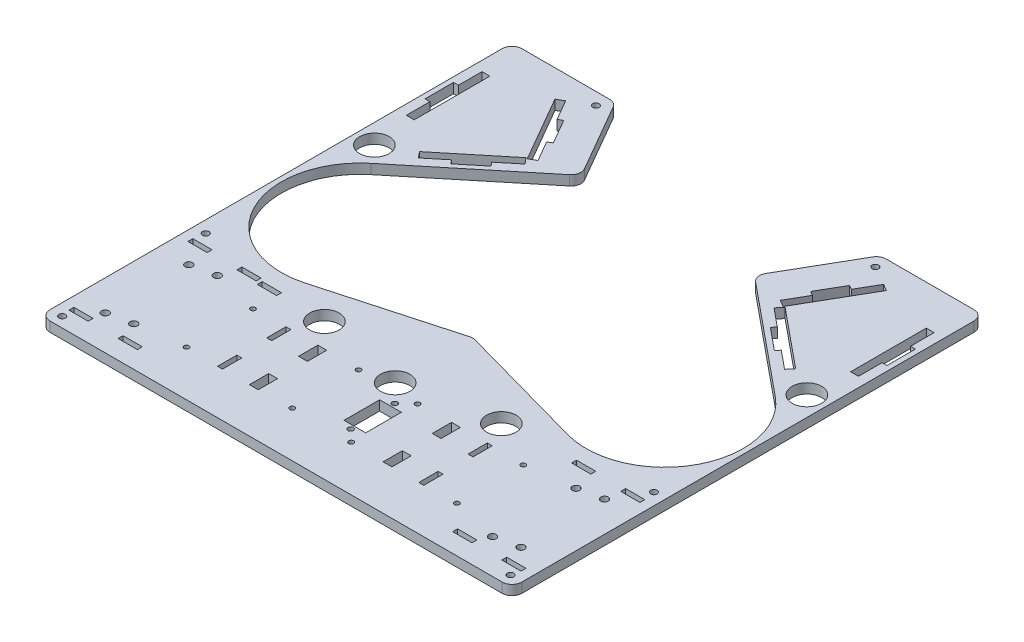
from build123d import *

# Parameters (mm, degrees)
SKETCH1_R      = 9.525
SKETCH1_R_2    = 2.0955
SKETCH1_R_3    = 2.38125
SKETCH1_R_4    = 1.5875
SKETCH1_R_5    = 1.75
SKETCH1_W      = 3.175
SKETCH1_H      = 12.446
SKETCH1_W_2    = 5.715
SKETCH1_W_3    = 12.446
SKETCH1_H_2    = 3.175
SKETCH1_W_4    = 14
SKETCH1_H_3    = 23
EXTRUDE1_DEPTH = 6.35


with BuildPart() as part:
    # Sketch1 → Extrude1 (new body)
    with BuildSketch(Plane(origin=(0, 0, 0), x_dir=(1, 0, 0), z_dir=(0, 1, 0))):
        with BuildLine():
            Line((-146.05, 0), (146.05, 0))
            ThreePointArc((146.05, 0), (150.540128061, 1.859871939), (152.4, 6.35))
            Line((152.4, 6.35), (152.4, 298.45))
            ThreePointArc((152.4, 298.45), (150.540128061, 302.940128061), (146.05, 304.8))
            Line((146.05, 304.8), (89.36603146, 304.8))
            ThreePointArc((89.36603146, 304.8), (86.19103146, 303.949261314), (83.866770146, 301.625))
            Line((83.866770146, 301.625), (58.575569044, 257.819354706))
            ThreePointArc((58.575569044, 257.819354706), (57.827779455, 253.505559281), (60.04963704, 249.733110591))
            Line((60.04963704, 249.733110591), (130.626546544, 191.889171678))
            ThreePointArc((130.626546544, 191.889171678), (143.510234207, 129.190637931), (84.815355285, 103.656215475))
            Line((84.815355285, 103.656215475), (1.701205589, 126.767875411))
            ThreePointArc((1.701205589, 126.767875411), (0, 127), (-1.701205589, 126.767875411))
            Line((-1.701205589, 126.767875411), (-84.815355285, 103.656215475))
            ThreePointArc((-84.815355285, 103.656215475), (-143.510234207, 129.190637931), (-130.626546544, 191.889171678))
            Line((-130.626546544, 191.889171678), (-60.04963704, 249.733110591))
            ThreePointArc((-60.04963704, 249.733110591), (-57.827779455, 253.505559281), (-58.575569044, 257.819354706))
            Line((-58.575569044, 257.819354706), (-83.866770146, 301.625))
            ThreePointArc((-83.866770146, 301.625), (-86.19103146, 303.949261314), (-89.36603146, 304.8))
            Line((-89.36603146, 304.8), (-146.05, 304.8))
            ThreePointArc((-146.05, 304.8), (-150.540128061, 302.940128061), (-152.4, 298.45))
            Line((-152.4, 298.45), (-152.4, 6.35))
            ThreePointArc((-152.4, 6.35), (-150.540128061, 1.859871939), (-146.05, 0))
        make_face()
        with Locations(Location((0, 76.934609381, 0), (0, 0, 270))):
            Circle(SKETCH1_R, mode=Mode.SUBTRACT)
        with Locations(Location((-144.78, 99.314, 0), (0, 0, 270))):
            Circle(SKETCH1_R_2, mode=Mode.SUBTRACT)
        with Locations(Location((-144.78, 6.604, 0), (0, 0, 90))):
            Circle(SKETCH1_R_2, mode=Mode.SUBTRACT)
        with Locations(Location((144.78, 6.604, 0), (0, 0, 270))):
            Circle(SKETCH1_R_2, mode=Mode.SUBTRACT)
        with Locations(Location((144.78, 99.314, 0), (0, 0, 90))):
            Circle(SKETCH1_R_2, mode=Mode.SUBTRACT)
        with Locations(Location((-117.475, 79.474609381, 0), (0, 0, 270))):
            Circle(SKETCH1_R_3, mode=Mode.SUBTRACT)
        with Locations(Location((-132.715, 76.299609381, 0), (0, 0, 270))):
            Circle(SKETCH1_R_3, mode=Mode.SUBTRACT)
        with Locations(Location((117.475, 76.299609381, 0), (0, 0, 270))):
            Circle(SKETCH1_R_3, mode=Mode.SUBTRACT)
        with Locations(Location((132.715, 79.474609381, 0), (0, 0, 270))):
            Circle(SKETCH1_R_3, mode=Mode.SUBTRACT)
        with Locations(Location((-132.715, 22.324609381, 0), (0, 0, 270))):
            Circle(SKETCH1_R_3, mode=Mode.SUBTRACT)
        with Locations(Location((-117.475, 25.499609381, 0), (0, 0, 270))):
            Circle(SKETCH1_R_3, mode=Mode.SUBTRACT)
        with Locations(Location((117.475, 22.324609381, 0), (0, 0, 270))):
            Circle(SKETCH1_R_3, mode=Mode.SUBTRACT)
        with Locations(Location((132.715, 25.499609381, 0), (0, 0, 270))):
            Circle(SKETCH1_R_3, mode=Mode.SUBTRACT)
        with Locations(Location((-57.15, 88.364609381, 0), (0, 0, 270))):
            Circle(SKETCH1_R, mode=Mode.SUBTRACT)
        with Locations(Location((57.15, 88.364609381, 0), (0, 0, 90))):
            Circle(SKETCH1_R, mode=Mode.SUBTRACT)
        with Locations(Location((-87.3125, 29.468359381, 0), (0, 0, 270))):
            Circle(SKETCH1_R_4, mode=Mode.SUBTRACT)
        with Locations(Location((-19.05, 29.468359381, 0), (0, 0, 270))):
            Circle(SKETCH1_R_4, mode=Mode.SUBTRACT)
        with Locations(Location((-87.3125, 72.330859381, 0), (0, 0, 270))):
            Circle(SKETCH1_R_4, mode=Mode.SUBTRACT)
        with Locations(Location((-19.05, 72.330859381, 0), (0, 0, 270))):
            Circle(SKETCH1_R_4, mode=Mode.SUBTRACT)
        with Locations(Location((87.3125, 72.330859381, 0), (0, 0, 90))):
            Circle(SKETCH1_R_4, mode=Mode.SUBTRACT)
        with Locations(Location((19.05, 72.330859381, 0), (0, 0, 90))):
            Circle(SKETCH1_R_4, mode=Mode.SUBTRACT)
        with Locations(Location((19.05, 29.468359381, 0), (0, 0, 90))):
            Circle(SKETCH1_R_4, mode=Mode.SUBTRACT)
        with Locations(Location((87.3125, 29.468359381, 0), (0, 0, 90))):
            Circle(SKETCH1_R_4, mode=Mode.SUBTRACT)
        with Locations(Location((-139.7, 203.2, 0), (0, 0, 270))):
            Circle(SKETCH1_R, mode=Mode.SUBTRACT)
        with Locations(Location((139.7, 203.2, 0), (0, 0, 90))):
            Circle(SKETCH1_R, mode=Mode.SUBTRACT)
        with Locations(Location((-90.282575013, 296.8625, 0), (0, 0, 270))):
            Circle(SKETCH1_R_2, mode=Mode.SUBTRACT)
        with Locations(Location((90.282575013, 296.8625, 0), (0, 0, 90))):
            Circle(SKETCH1_R_2, mode=Mode.SUBTRACT)
        with Locations(Location((11.482677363, 65.149609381, 0), (0, 0, 270))):
            Circle(SKETCH1_R_5, mode=Mode.SUBTRACT)
        with Locations(Location((11.482677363, 36.649609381, 0), (0, 0, 90))):
            Circle(SKETCH1_R_5, mode=Mode.SUBTRACT)
        Polygon((-85.864834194, 260.635748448), (-78.244834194, 247.437521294), (-82.644243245, 244.897521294), (-107.091743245, 287.241833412), (-102.692334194, 289.781833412), (-95.072334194, 276.583606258), (-92.322703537, 278.171106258), (-83.115203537, 262.223248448), align=None, mode=Mode.SUBTRACT)
        with Locations((-65.025, 66.774609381)):
            Rectangle(SKETCH1_W, SKETCH1_H, mode=Mode.SUBTRACT)
        with Locations((-43.18, 66.774609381)):
            Rectangle(SKETCH1_W_2, SKETCH1_H, mode=Mode.SUBTRACT)
        Polygon((-146.05, 263.851854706), (-146.05, 279.091854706), (-140.97, 279.091854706), (-140.97, 230.196854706), (-146.05, 230.196854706), (-146.05, 245.436854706), (-149.225, 245.436854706), (-149.225, 263.851854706), align=None, mode=Mode.SUBTRACT)
        with Locations((-43.18, 35.024609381)):
            Rectangle(SKETCH1_W_2, SKETCH1_H, mode=Mode.SUBTRACT)
        Polygon((-106.484589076, 219.885854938), (-118.271574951, 210.225390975), (-121.491729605, 214.154386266), (-83.675149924, 245.148374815), (-80.454995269, 241.219379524), (-92.241981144, 231.55891556), (-90.229384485, 229.103293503), (-104.471992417, 217.430232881), align=None, mode=Mode.SUBTRACT)
        with Locations((-139.827, 90.6145)):
            Rectangle(SKETCH1_W_3, SKETCH1_H_2, mode=Mode.SUBTRACT)
        Polygon((107.091743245, 287.241833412), (82.644243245, 244.897521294), (78.244834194, 247.437521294), (85.864834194, 260.635748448), (83.115203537, 262.223248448), (92.322703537, 278.171106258), (95.072334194, 276.583606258), (102.692334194, 289.781833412), align=None, mode=Mode.SUBTRACT)
        with Locations((-65.025, 35.024609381)):
            Rectangle(SKETCH1_W, SKETCH1_H, mode=Mode.SUBTRACT)
        with Locations((65.025, 35.024609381)):
            Rectangle(SKETCH1_W, SKETCH1_H, mode=Mode.SUBTRACT)
        with Locations((43.18, 35.024609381)):
            Rectangle(SKETCH1_W_2, SKETCH1_H, mode=Mode.SUBTRACT)
        with Locations((43.18, 66.774609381)):
            Rectangle(SKETCH1_W_2, SKETCH1_H, mode=Mode.SUBTRACT)
        with Locations((65.025, 66.774609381)):
            Rectangle(SKETCH1_W, SKETCH1_H, mode=Mode.SUBTRACT)
        Polygon((121.491729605, 214.154386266), (83.675149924, 245.148374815), (80.454995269, 241.219379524), (92.241981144, 231.55891556), (90.229384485, 229.103293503), (104.471992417, 217.430232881), (106.484589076, 219.885854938), (118.271574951, 210.225390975), align=None, mode=Mode.SUBTRACT)
        Polygon((149.225, 245.436854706), (146.05, 245.436854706), (146.05, 230.196854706), (140.97, 230.196854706), (140.97, 279.091854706), (146.05, 279.091854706), (146.05, 263.851854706), (149.225, 263.851854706), align=None, mode=Mode.SUBTRACT)
        with Locations((-108.077, 90.6145)):
            Rectangle(SKETCH1_W_3, SKETCH1_H_2, mode=Mode.SUBTRACT)
        with Locations((-108.077, 13.7795)):
            Rectangle(SKETCH1_W_3, SKETCH1_H_2, mode=Mode.SUBTRACT)
        with Locations((-139.827, 13.7795)):
            Rectangle(SKETCH1_W_3, SKETCH1_H_2, mode=Mode.SUBTRACT)
        with Locations((108.077, 90.6145)):
            Rectangle(SKETCH1_W_3, SKETCH1_H_2, mode=Mode.SUBTRACT)
        with Locations((139.827, 90.6145)):
            Rectangle(SKETCH1_W_3, SKETCH1_H_2, mode=Mode.SUBTRACT)
        with Locations((108.077, 13.7795)):
            Rectangle(SKETCH1_W_3, SKETCH1_H_2, mode=Mode.SUBTRACT)
        with Locations((139.827, 13.7795)):
            Rectangle(SKETCH1_W_3, SKETCH1_H_2, mode=Mode.SUBTRACT)
        with Locations((-93.345, 88.999609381)):
            Rectangle(SKETCH1_W_3, SKETCH1_H_2, mode=Mode.SUBTRACT)
        with Locations((11.482677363, 50.899609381)):
            Rectangle(SKETCH1_W_4, SKETCH1_H_3, mode=Mode.SUBTRACT)
    extrude(amount=EXTRUDE1_DEPTH)


solid = part.part
